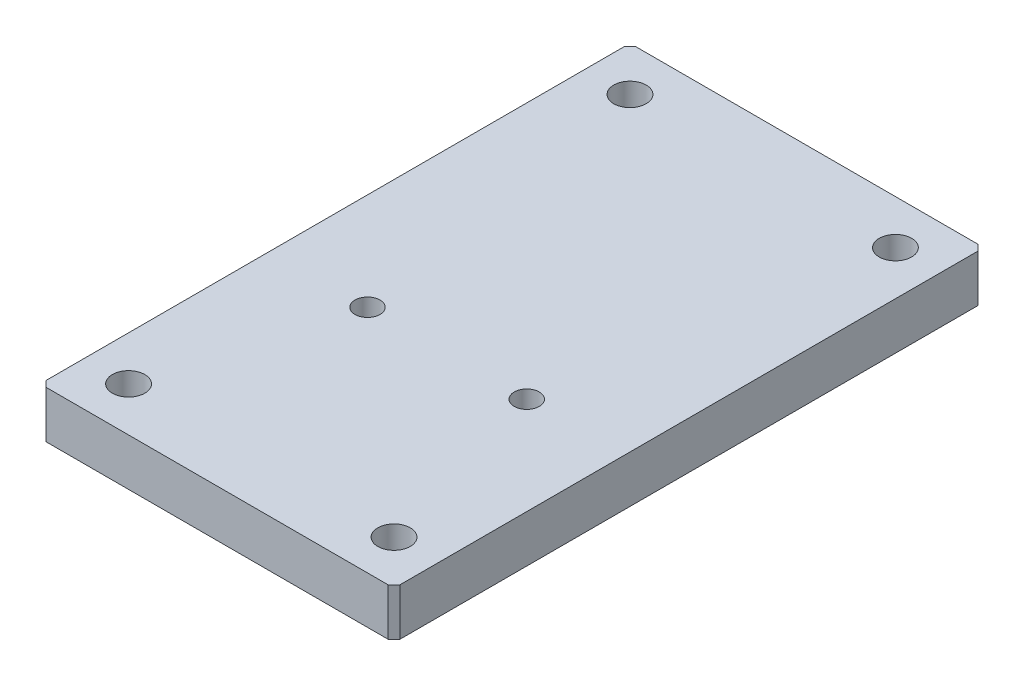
ISO-10303-21;
HEADER;
FILE_DESCRIPTION(('STEP AP214'),'2;1');
FILE_NAME('part.step','',(''),(''),'','','');
FILE_SCHEMA(('AUTOMOTIVE_DESIGN { 1 0 10303 214 1 1 1 1 }'));
ENDSEC;
DATA;
#1=APPLICATION_CONTEXT('core data for automotive mechanical design processes');
#2=APPLICATION_PROTOCOL_DEFINITION('international standard','automotive_design',2000,#1);
#3=PRODUCT_CONTEXT('',#1,'mechanical');
#4=PRODUCT('Part','Part','',(#3));
#5=PRODUCT_RELATED_PRODUCT_CATEGORY('part','',(#4));
#6=PRODUCT_DEFINITION_FORMATION('','',#4);
#7=PRODUCT_DEFINITION_CONTEXT('part definition',#1,'design');
#8=PRODUCT_DEFINITION('design','',#6,#7);
#9=PRODUCT_DEFINITION_SHAPE('','',#8);
#10=(LENGTH_UNIT() NAMED_UNIT(*) SI_UNIT(.MILLI.,.METRE.));
#11=(NAMED_UNIT(*) PLANE_ANGLE_UNIT() SI_UNIT($,.RADIAN.));
#12=(NAMED_UNIT(*) SI_UNIT($,.STERADIAN.) SOLID_ANGLE_UNIT());
#13=UNCERTAINTY_MEASURE_WITH_UNIT(LENGTH_MEASURE(1.E-05),#10,'distance_accuracy_value','');
#14=(GEOMETRIC_REPRESENTATION_CONTEXT(3) GLOBAL_UNCERTAINTY_ASSIGNED_CONTEXT((#13)) GLOBAL_UNIT_ASSIGNED_CONTEXT((#10,
#11,#12)) REPRESENTATION_CONTEXT('',''));
#15=CARTESIAN_POINT('',(0.,0.,0.));
#16=DIRECTION('',(0.,0.,1.));
#17=DIRECTION('',(1.,0.,0.));
#18=AXIS2_PLACEMENT_3D('',#15,#16,#17);
#19=CARTESIAN_POINT('',(-60.,16.,0.));
#20=DIRECTION('',(1.,0.,0.));
#21=DIRECTION('',(0.,0.,-1.));
#22=AXIS2_PLACEMENT_3D('',#19,#20,#21);
#23=PLANE('',#22);
#24=DIRECTION('',(0.,0.,1.));
#25=VECTOR('',#24,1.);
#26=CARTESIAN_POINT('',(-60.,16.,0.));
#27=LINE('',#26,#25);
#28=CARTESIAN_POINT('',(-60.,16.,-198.));
#29=VERTEX_POINT('',#28);
#30=CARTESIAN_POINT('',(-60.,16.,-2.00000000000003));
#31=VERTEX_POINT('',#30);
#32=EDGE_CURVE('E134',#29,#31,#27,.T.);
#33=ORIENTED_EDGE('',*,*,#32,.F.);
#34=DIRECTION('',(0.,-1.,0.));
#35=VECTOR('',#34,1.);
#36=CARTESIAN_POINT('',(-60.,16.,-198.));
#37=LINE('',#36,#35);
#38=CARTESIAN_POINT('',(-60.,0.,-198.));
#39=VERTEX_POINT('',#38);
#40=EDGE_CURVE('E119',#29,#39,#37,.T.);
#41=ORIENTED_EDGE('',*,*,#40,.T.);
#42=DIRECTION('',(0.,0.,1.));
#43=VECTOR('',#42,1.);
#44=CARTESIAN_POINT('',(-60.,0.,0.));
#45=LINE('',#44,#43);
#46=CARTESIAN_POINT('',(-60.,0.,-2.00000000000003));
#47=VERTEX_POINT('',#46);
#48=EDGE_CURVE('E131',#39,#47,#45,.T.);
#49=ORIENTED_EDGE('',*,*,#48,.T.);
#50=DIRECTION('',(0.,1.,0.));
#51=VECTOR('',#50,1.);
#52=CARTESIAN_POINT('',(-60.,16.,-2.00000000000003));
#53=LINE('',#52,#51);
#54=EDGE_CURVE('E136',#47,#31,#53,.T.);
#55=ORIENTED_EDGE('',*,*,#54,.T.);
#56=EDGE_LOOP('',(#33,#41,#49,#55));
#57=FACE_BOUND('',#56,.T.);
#58=ADVANCED_FACE('F48',(#57),#23,.F.);
#59=CARTESIAN_POINT('',(-60.,16.,0.));
#60=DIRECTION('',(0.,0.,-1.));
#61=DIRECTION('',(-1.,0.,0.));
#62=AXIS2_PLACEMENT_3D('',#59,#60,#61);
#63=PLANE('',#62);
#64=DIRECTION('',(1.,0.,0.));
#65=VECTOR('',#64,1.);
#66=CARTESIAN_POINT('',(-60.,16.,0.));
#67=LINE('',#66,#65);
#68=CARTESIAN_POINT('',(-58.,16.,0.));
#69=VERTEX_POINT('',#68);
#70=CARTESIAN_POINT('',(58.,16.,0.));
#71=VERTEX_POINT('',#70);
#72=EDGE_CURVE('E178',#69,#71,#67,.T.);
#73=ORIENTED_EDGE('',*,*,#72,.F.);
#74=DIRECTION('',(0.,-1.,0.));
#75=VECTOR('',#74,1.);
#76=CARTESIAN_POINT('',(-58.,16.,0.));
#77=LINE('',#76,#75);
#78=CARTESIAN_POINT('',(-58.,0.,0.));
#79=VERTEX_POINT('',#78);
#80=EDGE_CURVE('E13',#69,#79,#77,.T.);
#81=ORIENTED_EDGE('',*,*,#80,.T.);
#82=DIRECTION('',(1.,0.,0.));
#83=VECTOR('',#82,1.);
#84=CARTESIAN_POINT('',(-60.,0.,0.));
#85=LINE('',#84,#83);
#86=CARTESIAN_POINT('',(58.,0.,0.));
#87=VERTEX_POINT('',#86);
#88=EDGE_CURVE('E141',#79,#87,#85,.T.);
#89=ORIENTED_EDGE('',*,*,#88,.T.);
#90=DIRECTION('',(0.,1.,0.));
#91=VECTOR('',#90,1.);
#92=CARTESIAN_POINT('',(58.,16.,0.));
#93=LINE('',#92,#91);
#94=EDGE_CURVE('E56',#87,#71,#93,.T.);
#95=ORIENTED_EDGE('',*,*,#94,.T.);
#96=EDGE_LOOP('',(#73,#81,#89,#95));
#97=FACE_BOUND('',#96,.T.);
#98=ADVANCED_FACE('F177',(#97),#63,.F.);
#99=CARTESIAN_POINT('',(60.,16.,0.));
#100=DIRECTION('',(-1.,0.,0.));
#101=DIRECTION('',(0.,0.,1.));
#102=AXIS2_PLACEMENT_3D('',#99,#100,#101);
#103=PLANE('',#102);
#104=DIRECTION('',(0.,0.,-1.));
#105=VECTOR('',#104,1.);
#106=CARTESIAN_POINT('',(60.,0.,0.));
#107=LINE('',#106,#105);
#108=CARTESIAN_POINT('',(60.,0.,-1.99999999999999));
#109=VERTEX_POINT('',#108);
#110=CARTESIAN_POINT('',(60.,0.,-198.));
#111=VERTEX_POINT('',#110);
#112=EDGE_CURVE('E145',#109,#111,#107,.T.);
#113=ORIENTED_EDGE('',*,*,#112,.T.);
#114=DIRECTION('',(0.,1.,0.));
#115=VECTOR('',#114,1.);
#116=CARTESIAN_POINT('',(60.,16.,-198.));
#117=LINE('',#116,#115);
#118=CARTESIAN_POINT('',(60.,16.,-198.));
#119=VERTEX_POINT('',#118);
#120=EDGE_CURVE('E63',#111,#119,#117,.T.);
#121=ORIENTED_EDGE('',*,*,#120,.T.);
#122=DIRECTION('',(0.,0.,-1.));
#123=VECTOR('',#122,1.);
#124=CARTESIAN_POINT('',(60.,16.,0.));
#125=LINE('',#124,#123);
#126=CARTESIAN_POINT('',(60.,16.,-2.));
#127=VERTEX_POINT('',#126);
#128=EDGE_CURVE('E184',#127,#119,#125,.T.);
#129=ORIENTED_EDGE('',*,*,#128,.F.);
#130=DIRECTION('',(0.,-1.,0.));
#131=VECTOR('',#130,1.);
#132=CARTESIAN_POINT('',(60.,16.,-2.));
#133=LINE('',#132,#131);
#134=EDGE_CURVE('E171',#127,#109,#133,.T.);
#135=ORIENTED_EDGE('',*,*,#134,.T.);
#136=EDGE_LOOP('',(#113,#121,#129,#135));
#137=FACE_BOUND('',#136,.T.);
#138=ADVANCED_FACE('F188',(#137),#103,.F.);
#139=CARTESIAN_POINT('',(-60.,16.,-200.));
#140=DIRECTION('',(0.,0.,1.));
#141=DIRECTION('',(1.,0.,0.));
#142=AXIS2_PLACEMENT_3D('',#139,#140,#141);
#143=PLANE('',#142);
#144=DIRECTION('',(-1.,0.,0.));
#145=VECTOR('',#144,1.);
#146=CARTESIAN_POINT('',(-60.,0.,-200.));
#147=LINE('',#146,#145);
#148=CARTESIAN_POINT('',(58.,0.,-200.));
#149=VERTEX_POINT('',#148);
#150=CARTESIAN_POINT('',(-58.,0.,-200.));
#151=VERTEX_POINT('',#150);
#152=EDGE_CURVE('E155',#149,#151,#147,.T.);
#153=ORIENTED_EDGE('',*,*,#152,.T.);
#154=DIRECTION('',(0.,1.,0.));
#155=VECTOR('',#154,1.);
#156=CARTESIAN_POINT('',(-58.,16.,-200.));
#157=LINE('',#156,#155);
#158=CARTESIAN_POINT('',(-58.,16.,-200.));
#159=VERTEX_POINT('',#158);
#160=EDGE_CURVE('E120',#151,#159,#157,.T.);
#161=ORIENTED_EDGE('',*,*,#160,.T.);
#162=DIRECTION('',(-1.,0.,0.));
#163=VECTOR('',#162,1.);
#164=CARTESIAN_POINT('',(-60.,16.,-200.));
#165=LINE('',#164,#163);
#166=CARTESIAN_POINT('',(58.,16.,-200.));
#167=VERTEX_POINT('',#166);
#168=EDGE_CURVE('E151',#167,#159,#165,.T.);
#169=ORIENTED_EDGE('',*,*,#168,.F.);
#170=DIRECTION('',(0.,-1.,0.));
#171=VECTOR('',#170,1.);
#172=CARTESIAN_POINT('',(58.,16.,-200.));
#173=LINE('',#172,#171);
#174=EDGE_CURVE('E125',#167,#149,#173,.T.);
#175=ORIENTED_EDGE('',*,*,#174,.T.);
#176=EDGE_LOOP('',(#153,#161,#169,#175));
#177=FACE_BOUND('',#176,.T.);
#178=ADVANCED_FACE('F195',(#177),#143,.F.);
#179=CARTESIAN_POINT('',(0.,16.,0.));
#180=DIRECTION('',(0.,-1.,0.));
#181=DIRECTION('',(0.,0.,-1.));
#182=AXIS2_PLACEMENT_3D('',#179,#180,#181);
#183=PLANE('',#182);
#184=CARTESIAN_POINT('',(-45.,16.,-15.));
#185=DIRECTION('',(0.,1.,0.));
#186=DIRECTION('',(0.,0.,1.));
#187=AXIS2_PLACEMENT_3D('',#184,#185,#186);
#188=CIRCLE('',#187,5.5);
#189=CARTESIAN_POINT('',(-45.,16.,-9.5));
#190=VERTEX_POINT('',#189);
#191=EDGE_CURVE('E225',#190,#190,#188,.T.);
#192=ORIENTED_EDGE('',*,*,#191,.F.);
#193=EDGE_LOOP('',(#192));
#194=FACE_BOUND('',#193,.T.);
#195=CARTESIAN_POINT('',(45.,16.,-15.));
#196=DIRECTION('',(0.,1.,0.));
#197=DIRECTION('',(0.,0.,1.));
#198=AXIS2_PLACEMENT_3D('',#195,#196,#197);
#199=CIRCLE('',#198,5.5);
#200=CARTESIAN_POINT('',(45.,16.,-9.5));
#201=VERTEX_POINT('',#200);
#202=EDGE_CURVE('E219',#201,#201,#199,.T.);
#203=ORIENTED_EDGE('',*,*,#202,.F.);
#204=EDGE_LOOP('',(#203));
#205=FACE_BOUND('',#204,.T.);
#206=CARTESIAN_POINT('',(45.,16.,-185.));
#207=DIRECTION('',(0.,1.,0.));
#208=DIRECTION('',(0.,0.,1.));
#209=AXIS2_PLACEMENT_3D('',#206,#207,#208);
#210=CIRCLE('',#209,5.5);
#211=CARTESIAN_POINT('',(45.,16.,-179.5));
#212=VERTEX_POINT('',#211);
#213=EDGE_CURVE('E213',#212,#212,#210,.T.);
#214=ORIENTED_EDGE('',*,*,#213,.F.);
#215=EDGE_LOOP('',(#214));
#216=FACE_BOUND('',#215,.T.);
#217=CARTESIAN_POINT('',(-45.,16.,-185.));
#218=DIRECTION('',(0.,1.,0.));
#219=DIRECTION('',(0.,0.,1.));
#220=AXIS2_PLACEMENT_3D('',#217,#218,#219);
#221=CIRCLE('',#220,5.5);
#222=CARTESIAN_POINT('',(-45.,16.,-179.5));
#223=VERTEX_POINT('',#222);
#224=EDGE_CURVE('E207',#223,#223,#221,.T.);
#225=ORIENTED_EDGE('',*,*,#224,.F.);
#226=EDGE_LOOP('',(#225));
#227=FACE_BOUND('',#226,.T.);
#228=CARTESIAN_POINT('',(-27.,16.,-78.));
#229=DIRECTION('',(0.,1.,0.));
#230=DIRECTION('',(0.,0.,1.));
#231=AXIS2_PLACEMENT_3D('',#228,#229,#230);
#232=CIRCLE('',#231,4.24999999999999);
#233=CARTESIAN_POINT('',(-27.,16.,-73.75));
#234=VERTEX_POINT('',#233);
#235=EDGE_CURVE('E203',#234,#234,#232,.T.);
#236=ORIENTED_EDGE('',*,*,#235,.F.);
#237=EDGE_LOOP('',(#236));
#238=FACE_BOUND('',#237,.T.);
#239=CARTESIAN_POINT('',(27.,16.,-78.));
#240=DIRECTION('',(0.,1.,0.));
#241=DIRECTION('',(0.,0.,1.));
#242=AXIS2_PLACEMENT_3D('',#239,#240,#241);
#243=CIRCLE('',#242,4.24999999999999);
#244=CARTESIAN_POINT('',(27.,16.,-73.75));
#245=VERTEX_POINT('',#244);
#246=EDGE_CURVE('E148',#245,#245,#243,.T.);
#247=ORIENTED_EDGE('',*,*,#246,.F.);
#248=EDGE_LOOP('',(#247));
#249=FACE_BOUND('',#248,.T.);
#250=ORIENTED_EDGE('',*,*,#168,.T.);
#251=DIRECTION('',(0.707106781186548,0.,-0.707106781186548));
#252=VECTOR('',#251,1.);
#253=CARTESIAN_POINT('',(-60.,16.,-198.));
#254=LINE('',#253,#252);
#255=EDGE_CURVE('E169',#159,#29,#254,.F.);
#256=ORIENTED_EDGE('',*,*,#255,.T.);
#257=ORIENTED_EDGE('',*,*,#32,.T.);
#258=DIRECTION('',(-0.707106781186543,0.,-0.707106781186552));
#259=VECTOR('',#258,1.);
#260=CARTESIAN_POINT('',(-58.,16.,0.));
#261=LINE('',#260,#259);
#262=EDGE_CURVE('E165',#31,#69,#261,.F.);
#263=ORIENTED_EDGE('',*,*,#262,.T.);
#264=ORIENTED_EDGE('',*,*,#72,.T.);
#265=DIRECTION('',(-0.707106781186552,0.,0.707106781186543));
#266=VECTOR('',#265,1.);
#267=CARTESIAN_POINT('',(60.,16.,-2.));
#268=LINE('',#267,#266);
#269=EDGE_CURVE('E70',#71,#127,#268,.F.);
#270=ORIENTED_EDGE('',*,*,#269,.T.);
#271=ORIENTED_EDGE('',*,*,#128,.T.);
#272=DIRECTION('',(0.707106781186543,0.,0.707106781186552));
#273=VECTOR('',#272,1.);
#274=CARTESIAN_POINT('',(58.,16.,-200.));
#275=LINE('',#274,#273);
#276=EDGE_CURVE('E167',#119,#167,#275,.F.);
#277=ORIENTED_EDGE('',*,*,#276,.T.);
#278=EDGE_LOOP('',(#250,#256,#257,#263,#264,#270,#271,#277));
#279=FACE_BOUND('',#278,.T.);
#280=ADVANCED_FACE('F182',(#194,#205,#216,#227,#238,#249,#279),#183,.F.);
#281=CARTESIAN_POINT('',(0.,0.,0.));
#282=DIRECTION('',(0.,-1.,0.));
#283=DIRECTION('',(0.,0.,-1.));
#284=AXIS2_PLACEMENT_3D('',#281,#282,#283);
#285=PLANE('',#284);
#286=CARTESIAN_POINT('',(-45.,0.,-15.));
#287=DIRECTION('',(0.,1.,0.));
#288=DIRECTION('',(0.,0.,1.));
#289=AXIS2_PLACEMENT_3D('',#286,#287,#288);
#290=CIRCLE('',#289,5.5);
#291=CARTESIAN_POINT('',(-45.,0.,-9.5));
#292=VERTEX_POINT('',#291);
#293=EDGE_CURVE('E222',#292,#292,#290,.T.);
#294=ORIENTED_EDGE('',*,*,#293,.T.);
#295=EDGE_LOOP('',(#294));
#296=FACE_BOUND('',#295,.T.);
#297=CARTESIAN_POINT('',(45.,0.,-15.));
#298=DIRECTION('',(0.,1.,0.));
#299=DIRECTION('',(0.,0.,1.));
#300=AXIS2_PLACEMENT_3D('',#297,#298,#299);
#301=CIRCLE('',#300,5.5);
#302=CARTESIAN_POINT('',(45.,0.,-9.5));
#303=VERTEX_POINT('',#302);
#304=EDGE_CURVE('E216',#303,#303,#301,.T.);
#305=ORIENTED_EDGE('',*,*,#304,.T.);
#306=EDGE_LOOP('',(#305));
#307=FACE_BOUND('',#306,.T.);
#308=CARTESIAN_POINT('',(45.,0.,-185.));
#309=DIRECTION('',(0.,1.,0.));
#310=DIRECTION('',(0.,0.,1.));
#311=AXIS2_PLACEMENT_3D('',#308,#309,#310);
#312=CIRCLE('',#311,5.5);
#313=CARTESIAN_POINT('',(45.,0.,-179.5));
#314=VERTEX_POINT('',#313);
#315=EDGE_CURVE('E210',#314,#314,#312,.T.);
#316=ORIENTED_EDGE('',*,*,#315,.T.);
#317=EDGE_LOOP('',(#316));
#318=FACE_BOUND('',#317,.T.);
#319=CARTESIAN_POINT('',(-45.,0.,-185.));
#320=DIRECTION('',(0.,1.,0.));
#321=DIRECTION('',(0.,0.,1.));
#322=AXIS2_PLACEMENT_3D('',#319,#320,#321);
#323=CIRCLE('',#322,5.5);
#324=CARTESIAN_POINT('',(-45.,0.,-179.5));
#325=VERTEX_POINT('',#324);
#326=EDGE_CURVE('E206',#325,#325,#323,.T.);
#327=ORIENTED_EDGE('',*,*,#326,.T.);
#328=EDGE_LOOP('',(#327));
#329=FACE_BOUND('',#328,.T.);
#330=CARTESIAN_POINT('',(-27.,0.,-78.));
#331=DIRECTION('',(0.,1.,0.));
#332=DIRECTION('',(0.,0.,1.));
#333=AXIS2_PLACEMENT_3D('',#330,#331,#332);
#334=CIRCLE('',#333,4.24999999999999);
#335=CARTESIAN_POINT('',(-27.,0.,-73.75));
#336=VERTEX_POINT('',#335);
#337=EDGE_CURVE('E200',#336,#336,#334,.T.);
#338=ORIENTED_EDGE('',*,*,#337,.T.);
#339=EDGE_LOOP('',(#338));
#340=FACE_BOUND('',#339,.T.);
#341=CARTESIAN_POINT('',(27.,0.,-78.));
#342=DIRECTION('',(0.,1.,0.));
#343=DIRECTION('',(0.,0.,1.));
#344=AXIS2_PLACEMENT_3D('',#341,#342,#343);
#345=CIRCLE('',#344,4.24999999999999);
#346=CARTESIAN_POINT('',(27.,0.,-73.75));
#347=VERTEX_POINT('',#346);
#348=EDGE_CURVE('E142',#347,#347,#345,.T.);
#349=ORIENTED_EDGE('',*,*,#348,.T.);
#350=EDGE_LOOP('',(#349));
#351=FACE_BOUND('',#350,.T.);
#352=ORIENTED_EDGE('',*,*,#48,.F.);
#353=DIRECTION('',(-0.707106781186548,0.,0.707106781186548));
#354=VECTOR('',#353,1.);
#355=CARTESIAN_POINT('',(-129.,0.,-129.));
#356=LINE('',#355,#354);
#357=EDGE_CURVE('E115',#39,#151,#356,.F.);
#358=ORIENTED_EDGE('',*,*,#357,.T.);
#359=ORIENTED_EDGE('',*,*,#152,.F.);
#360=DIRECTION('',(-0.707106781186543,0.,-0.707106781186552));
#361=VECTOR('',#360,1.);
#362=CARTESIAN_POINT('',(129.,0.,-128.999999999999));
#363=LINE('',#362,#361);
#364=EDGE_CURVE('E126',#149,#111,#363,.F.);
#365=ORIENTED_EDGE('',*,*,#364,.T.);
#366=ORIENTED_EDGE('',*,*,#112,.F.);
#367=DIRECTION('',(0.707106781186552,0.,-0.707106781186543));
#368=VECTOR('',#367,1.);
#369=CARTESIAN_POINT('',(28.9999999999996,0.,29.));
#370=LINE('',#369,#368);
#371=EDGE_CURVE('E135',#109,#87,#370,.F.);
#372=ORIENTED_EDGE('',*,*,#371,.T.);
#373=ORIENTED_EDGE('',*,*,#88,.F.);
#374=DIRECTION('',(0.707106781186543,0.,0.707106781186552));
#375=VECTOR('',#374,1.);
#376=CARTESIAN_POINT('',(-29.0000000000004,0.,29.));
#377=LINE('',#376,#375);
#378=EDGE_CURVE('E140',#79,#47,#377,.F.);
#379=ORIENTED_EDGE('',*,*,#378,.T.);
#380=EDGE_LOOP('',(#352,#358,#359,#365,#366,#372,#373,#379));
#381=FACE_BOUND('',#380,.T.);
#382=ADVANCED_FACE('F138',(#296,#307,#318,#329,#340,#351,#381),#285,.T.);
#383=CARTESIAN_POINT('',(27.,16.,-78.));
#384=DIRECTION('',(0.,1.,0.));
#385=DIRECTION('',(0.,0.,1.));
#386=AXIS2_PLACEMENT_3D('',#383,#384,#385);
#387=CYLINDRICAL_SURFACE('',#386,4.24999999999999);
#388=ORIENTED_EDGE('',*,*,#348,.F.);
#389=EDGE_LOOP('',(#388));
#390=FACE_BOUND('',#389,.T.);
#391=ORIENTED_EDGE('',*,*,#246,.T.);
#392=EDGE_LOOP('',(#391));
#393=FACE_BOUND('',#392,.T.);
#394=ADVANCED_FACE('F253',(#390,#393),#387,.F.);
#395=CARTESIAN_POINT('',(-27.,16.,-78.));
#396=DIRECTION('',(0.,1.,0.));
#397=DIRECTION('',(0.,0.,1.));
#398=AXIS2_PLACEMENT_3D('',#395,#396,#397);
#399=CYLINDRICAL_SURFACE('',#398,4.24999999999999);
#400=ORIENTED_EDGE('',*,*,#337,.F.);
#401=EDGE_LOOP('',(#400));
#402=FACE_BOUND('',#401,.T.);
#403=ORIENTED_EDGE('',*,*,#235,.T.);
#404=EDGE_LOOP('',(#403));
#405=FACE_BOUND('',#404,.T.);
#406=ADVANCED_FACE('F255',(#402,#405),#399,.F.);
#407=CARTESIAN_POINT('',(-45.,0.,-185.));
#408=DIRECTION('',(0.,1.,0.));
#409=DIRECTION('',(0.,0.,1.));
#410=AXIS2_PLACEMENT_3D('',#407,#408,#409);
#411=CYLINDRICAL_SURFACE('',#410,5.5);
#412=ORIENTED_EDGE('',*,*,#326,.F.);
#413=EDGE_LOOP('',(#412));
#414=FACE_BOUND('',#413,.T.);
#415=ORIENTED_EDGE('',*,*,#224,.T.);
#416=EDGE_LOOP('',(#415));
#417=FACE_BOUND('',#416,.T.);
#418=ADVANCED_FACE('F262',(#414,#417),#411,.F.);
#419=CARTESIAN_POINT('',(45.,0.,-185.));
#420=DIRECTION('',(0.,1.,0.));
#421=DIRECTION('',(0.,0.,1.));
#422=AXIS2_PLACEMENT_3D('',#419,#420,#421);
#423=CYLINDRICAL_SURFACE('',#422,5.5);
#424=ORIENTED_EDGE('',*,*,#315,.F.);
#425=EDGE_LOOP('',(#424));
#426=FACE_BOUND('',#425,.T.);
#427=ORIENTED_EDGE('',*,*,#213,.T.);
#428=EDGE_LOOP('',(#427));
#429=FACE_BOUND('',#428,.T.);
#430=ADVANCED_FACE('F355',(#426,#429),#423,.F.);
#431=CARTESIAN_POINT('',(45.,0.,-15.));
#432=DIRECTION('',(0.,1.,0.));
#433=DIRECTION('',(0.,0.,1.));
#434=AXIS2_PLACEMENT_3D('',#431,#432,#433);
#435=CYLINDRICAL_SURFACE('',#434,5.5);
#436=ORIENTED_EDGE('',*,*,#304,.F.);
#437=EDGE_LOOP('',(#436));
#438=FACE_BOUND('',#437,.T.);
#439=ORIENTED_EDGE('',*,*,#202,.T.);
#440=EDGE_LOOP('',(#439));
#441=FACE_BOUND('',#440,.T.);
#442=ADVANCED_FACE('F236',(#438,#441),#435,.F.);
#443=CARTESIAN_POINT('',(-45.,0.,-15.));
#444=DIRECTION('',(0.,1.,0.));
#445=DIRECTION('',(0.,0.,1.));
#446=AXIS2_PLACEMENT_3D('',#443,#444,#445);
#447=CYLINDRICAL_SURFACE('',#446,5.5);
#448=ORIENTED_EDGE('',*,*,#293,.F.);
#449=EDGE_LOOP('',(#448));
#450=FACE_BOUND('',#449,.T.);
#451=ORIENTED_EDGE('',*,*,#191,.T.);
#452=EDGE_LOOP('',(#451));
#453=FACE_BOUND('',#452,.T.);
#454=ADVANCED_FACE('F233',(#450,#453),#447,.F.);
#455=CARTESIAN_POINT('',(-60.,16.,-198.));
#456=DIRECTION('',(0.707106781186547,0.,0.707106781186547));
#457=DIRECTION('',(0.,-1.,0.));
#458=AXIS2_PLACEMENT_3D('',#455,#456,#457);
#459=PLANE('',#458);
#460=ORIENTED_EDGE('',*,*,#255,.F.);
#461=ORIENTED_EDGE('',*,*,#160,.F.);
#462=ORIENTED_EDGE('',*,*,#357,.F.);
#463=ORIENTED_EDGE('',*,*,#40,.F.);
#464=EDGE_LOOP('',(#460,#461,#462,#463));
#465=FACE_BOUND('',#464,.T.);
#466=ADVANCED_FACE('F118',(#465),#459,.F.);
#467=CARTESIAN_POINT('',(58.,16.,-200.));
#468=DIRECTION('',(-0.707106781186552,0.,0.707106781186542));
#469=DIRECTION('',(0.,-1.,0.));
#470=AXIS2_PLACEMENT_3D('',#467,#468,#469);
#471=PLANE('',#470);
#472=ORIENTED_EDGE('',*,*,#276,.F.);
#473=ORIENTED_EDGE('',*,*,#120,.F.);
#474=ORIENTED_EDGE('',*,*,#364,.F.);
#475=ORIENTED_EDGE('',*,*,#174,.F.);
#476=EDGE_LOOP('',(#472,#473,#474,#475));
#477=FACE_BOUND('',#476,.T.);
#478=ADVANCED_FACE('F192',(#477),#471,.F.);
#479=CARTESIAN_POINT('',(-58.,16.,0.));
#480=DIRECTION('',(0.707106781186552,0.,-0.707106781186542));
#481=DIRECTION('',(0.,-1.,0.));
#482=AXIS2_PLACEMENT_3D('',#479,#480,#481);
#483=PLANE('',#482);
#484=ORIENTED_EDGE('',*,*,#262,.F.);
#485=ORIENTED_EDGE('',*,*,#54,.F.);
#486=ORIENTED_EDGE('',*,*,#378,.F.);
#487=ORIENTED_EDGE('',*,*,#80,.F.);
#488=EDGE_LOOP('',(#484,#485,#486,#487));
#489=FACE_BOUND('',#488,.T.);
#490=ADVANCED_FACE('F278',(#489),#483,.F.);
#491=CARTESIAN_POINT('',(60.,16.,-2.));
#492=DIRECTION('',(-0.707106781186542,0.,-0.707106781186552));
#493=DIRECTION('',(0.,-1.,0.));
#494=AXIS2_PLACEMENT_3D('',#491,#492,#493);
#495=PLANE('',#494);
#496=ORIENTED_EDGE('',*,*,#269,.F.);
#497=ORIENTED_EDGE('',*,*,#94,.F.);
#498=ORIENTED_EDGE('',*,*,#371,.F.);
#499=ORIENTED_EDGE('',*,*,#134,.F.);
#500=EDGE_LOOP('',(#496,#497,#498,#499));
#501=FACE_BOUND('',#500,.T.);
#502=ADVANCED_FACE('F50',(#501),#495,.F.);
#503=CLOSED_SHELL('',(#58,#98,#138,#178,#280,#382,#394,#406,#418,#430,#442,#454,#466,#478,#490,#502));
#504=MANIFOLD_SOLID_BREP('B2',#503);
#505=ADVANCED_BREP_SHAPE_REPRESENTATION('',(#18,#504),#14);
#506=SHAPE_DEFINITION_REPRESENTATION(#9,#505);
ENDSEC;
END-ISO-10303-21;
